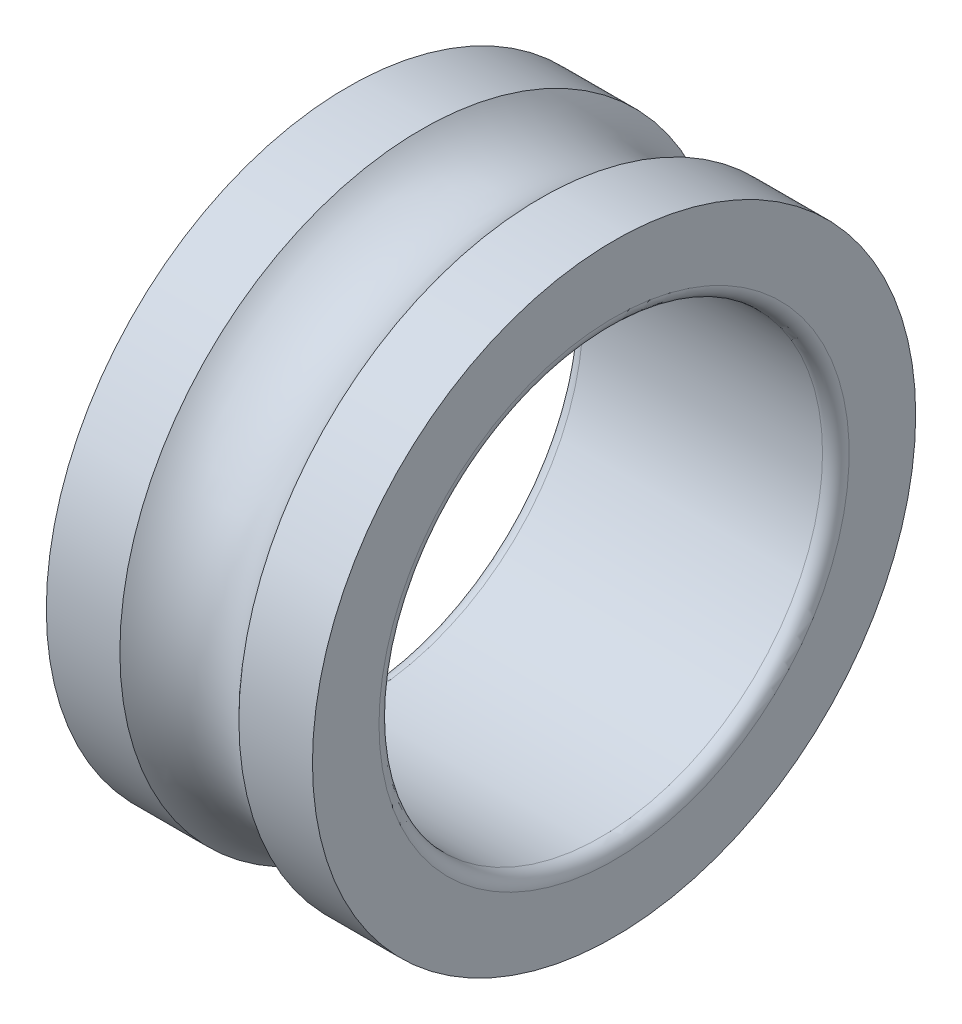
from build123d import *


with BuildPart() as part:
    # Esquisse1 → Base-R_volution (revolve)
    with BuildSketch(Plane(origin=(0, 0, 0), x_dir=(1, 0, 0), z_dir=(0, 1, 0)), mode=Mode.PRIVATE) as base_r_volution_sk:
        with BuildLine():
            Line((0, 6.8), (0, 5.3))
            ThreePointArc((0, 5.3), (0.087867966, 5.087867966), (0.3, 5))
            Line((0.3, 5), (5.7, 5))
            ThreePointArc((5.7, 5), (5.912132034, 5.087867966), (6, 5.3))
            Line((6, 5.3), (6, 6.8))
            Line((6, 6.8), (4.341640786, 6.8))
            ThreePointArc((4.341640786, 6.8), (3, 6.2), (1.658359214, 6.8))
            Line((1.658359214, 6.8), (0, 6.8))
        make_face()
    revolve(base_r_volution_sk.sketch.rotate(Axis((0, 0, 0), (1, 0, 0)), 180), axis=Axis((0, 0, 0), (1, 0, 0)))


solid = part.part
